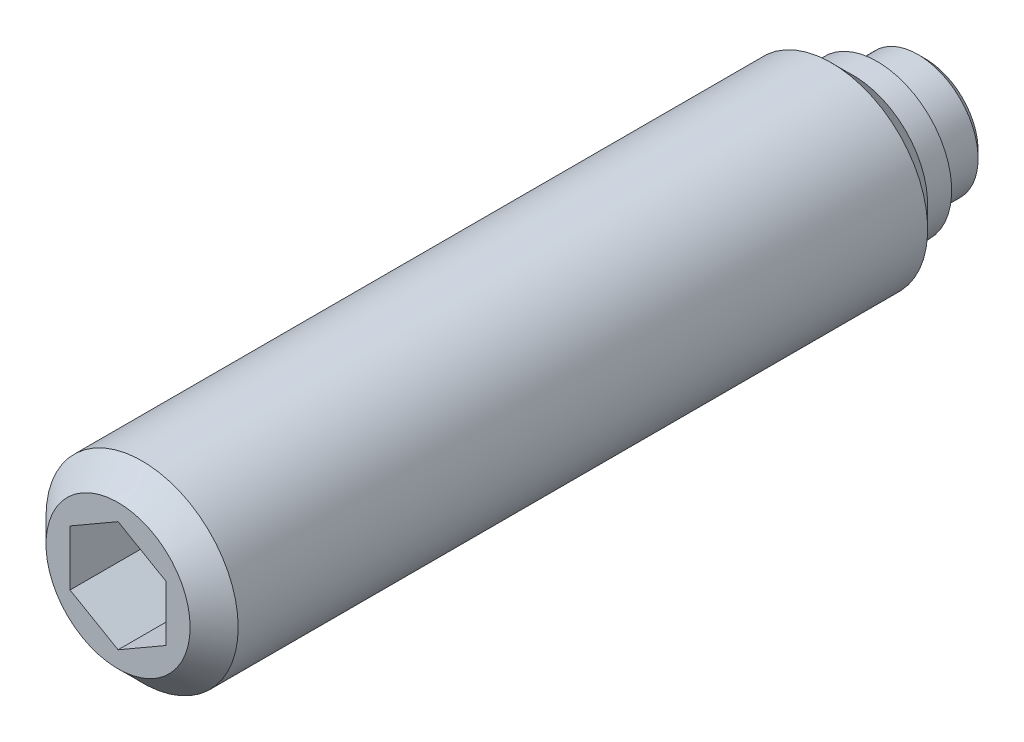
ISO-10303-21;
HEADER;
FILE_DESCRIPTION(('STEP AP214'),'2;1');
FILE_NAME('part.step','',(''),(''),'','','');
FILE_SCHEMA(('AUTOMOTIVE_DESIGN { 1 0 10303 214 1 1 1 1 }'));
ENDSEC;
DATA;
#1=APPLICATION_CONTEXT('core data for automotive mechanical design processes');
#2=APPLICATION_PROTOCOL_DEFINITION('international standard','automotive_design',2000,#1);
#3=PRODUCT_CONTEXT('',#1,'mechanical');
#4=PRODUCT('Part','Part','',(#3));
#5=PRODUCT_RELATED_PRODUCT_CATEGORY('part','',(#4));
#6=PRODUCT_DEFINITION_FORMATION('','',#4);
#7=PRODUCT_DEFINITION_CONTEXT('part definition',#1,'design');
#8=PRODUCT_DEFINITION('design','',#6,#7);
#9=PRODUCT_DEFINITION_SHAPE('','',#8);
#10=(LENGTH_UNIT() NAMED_UNIT(*) SI_UNIT(.MILLI.,.METRE.));
#11=(NAMED_UNIT(*) PLANE_ANGLE_UNIT() SI_UNIT($,.RADIAN.));
#12=(NAMED_UNIT(*) SI_UNIT($,.STERADIAN.) SOLID_ANGLE_UNIT());
#13=UNCERTAINTY_MEASURE_WITH_UNIT(LENGTH_MEASURE(1.E-05),#10,'distance_accuracy_value','');
#14=(GEOMETRIC_REPRESENTATION_CONTEXT(3) GLOBAL_UNCERTAINTY_ASSIGNED_CONTEXT((#13)) GLOBAL_UNIT_ASSIGNED_CONTEXT((#10,
#11,#12)) REPRESENTATION_CONTEXT('',''));
#15=CARTESIAN_POINT('',(0.,0.,0.));
#16=DIRECTION('',(0.,0.,1.));
#17=DIRECTION('',(1.,0.,0.));
#18=AXIS2_PLACEMENT_3D('',#15,#16,#17);
#19=CARTESIAN_POINT('',(0.,0.,0.));
#20=DIRECTION('',(0.,0.,-1.));
#21=DIRECTION('',(-1.,0.,0.));
#22=AXIS2_PLACEMENT_3D('',#19,#20,#21);
#23=CYLINDRICAL_SURFACE('',#22,2.5);
#24=CARTESIAN_POINT('',(0.,0.,0.3));
#25=DIRECTION('',(0.,0.,-1.));
#26=DIRECTION('',(-1.,0.,0.));
#27=AXIS2_PLACEMENT_3D('',#24,#25,#26);
#28=CIRCLE('',#27,2.5);
#29=CARTESIAN_POINT('',(-2.5,0.,0.3));
#30=VERTEX_POINT('',#29);
#31=EDGE_CURVE('E133',#30,#30,#28,.T.);
#32=ORIENTED_EDGE('',*,*,#31,.F.);
#33=EDGE_LOOP('',(#32));
#34=FACE_BOUND('',#33,.T.);
#35=CARTESIAN_POINT('',(0.,0.,2.));
#36=DIRECTION('',(0.,0.,-1.));
#37=DIRECTION('',(-1.,0.,0.));
#38=AXIS2_PLACEMENT_3D('',#35,#36,#37);
#39=CIRCLE('',#38,2.5);
#40=CARTESIAN_POINT('',(-2.5,0.,2.));
#41=VERTEX_POINT('',#40);
#42=EDGE_CURVE('E127',#41,#41,#39,.T.);
#43=ORIENTED_EDGE('',*,*,#42,.T.);
#44=EDGE_LOOP('',(#43));
#45=FACE_BOUND('',#44,.T.);
#46=ADVANCED_FACE('F14',(#34,#45),#23,.T.);
#47=CARTESIAN_POINT('',(0.,0.,0.3));
#48=DIRECTION('',(0.,0.,1.));
#49=DIRECTION('',(1.,0.,0.));
#50=AXIS2_PLACEMENT_3D('',#47,#48,#49);
#51=CONICAL_SURFACE('',#50,2.5,0.785398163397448);
#52=CARTESIAN_POINT('',(0.,0.,0.));
#53=DIRECTION('',(0.,0.,-1.));
#54=DIRECTION('',(-1.,0.,0.));
#55=AXIS2_PLACEMENT_3D('',#52,#53,#54);
#56=CIRCLE('',#55,2.2);
#57=CARTESIAN_POINT('',(-2.2,0.,0.));
#58=VERTEX_POINT('',#57);
#59=EDGE_CURVE('E130',#58,#58,#56,.T.);
#60=ORIENTED_EDGE('',*,*,#59,.F.);
#61=EDGE_LOOP('',(#60));
#62=FACE_BOUND('',#61,.T.);
#63=ORIENTED_EDGE('',*,*,#31,.T.);
#64=EDGE_LOOP('',(#63));
#65=FACE_BOUND('',#64,.T.);
#66=ADVANCED_FACE('F159',(#62,#65),#51,.T.);
#67=CARTESIAN_POINT('',(0.,2.2,0.));
#68=DIRECTION('',(0.,0.,1.));
#69=DIRECTION('',(1.,0.,0.));
#70=AXIS2_PLACEMENT_3D('',#67,#68,#69);
#71=PLANE('',#70);
#72=ORIENTED_EDGE('',*,*,#59,.T.);
#73=EDGE_LOOP('',(#72));
#74=FACE_BOUND('',#73,.T.);
#75=ADVANCED_FACE('F165',(#74),#71,.F.);
#76=CARTESIAN_POINT('',(0.,0.,2.));
#77=DIRECTION('',(0.,0.,-1.));
#78=DIRECTION('',(-1.,0.,0.));
#79=AXIS2_PLACEMENT_3D('',#76,#77,#78);
#80=CYLINDRICAL_SURFACE('',#79,4.);
#81=CARTESIAN_POINT('',(0.,0.,3.9));
#82=DIRECTION('',(0.,0.,-1.));
#83=DIRECTION('',(-1.,0.,0.));
#84=AXIS2_PLACEMENT_3D('',#81,#82,#83);
#85=CIRCLE('',#84,4.);
#86=CARTESIAN_POINT('',(-4.,0.,3.9));
#87=VERTEX_POINT('',#86);
#88=EDGE_CURVE('E9',#87,#87,#85,.T.);
#89=ORIENTED_EDGE('',*,*,#88,.F.);
#90=EDGE_LOOP('',(#89));
#91=FACE_BOUND('',#90,.T.);
#92=CARTESIAN_POINT('',(0.,0.,32.6));
#93=DIRECTION('',(0.,0.,1.));
#94=DIRECTION('',(1.,0.,0.));
#95=AXIS2_PLACEMENT_3D('',#92,#93,#94);
#96=CIRCLE('',#95,4.);
#97=CARTESIAN_POINT('',(4.,0.,32.6));
#98=VERTEX_POINT('',#97);
#99=EDGE_CURVE('E124',#98,#98,#96,.T.);
#100=ORIENTED_EDGE('',*,*,#99,.F.);
#101=EDGE_LOOP('',(#100));
#102=FACE_BOUND('',#101,.T.);
#103=ADVANCED_FACE('F16',(#91,#102),#80,.T.);
#104=CARTESIAN_POINT('',(0.,3.1,2.));
#105=DIRECTION('',(0.,0.,1.));
#106=DIRECTION('',(1.,0.,0.));
#107=AXIS2_PLACEMENT_3D('',#104,#105,#106);
#108=PLANE('',#107);
#109=CARTESIAN_POINT('',(0.,0.,2.));
#110=DIRECTION('',(0.,0.,-1.));
#111=DIRECTION('',(-1.,0.,0.));
#112=AXIS2_PLACEMENT_3D('',#109,#110,#111);
#113=CIRCLE('',#112,3.1);
#114=CARTESIAN_POINT('',(-3.1,0.,2.));
#115=VERTEX_POINT('',#114);
#116=EDGE_CURVE('E136',#115,#115,#113,.T.);
#117=ORIENTED_EDGE('',*,*,#116,.T.);
#118=EDGE_LOOP('',(#117));
#119=FACE_BOUND('',#118,.T.);
#120=ORIENTED_EDGE('',*,*,#42,.F.);
#121=EDGE_LOOP('',(#120));
#122=FACE_BOUND('',#121,.T.);
#123=ADVANCED_FACE('F156',(#119,#122),#108,.F.);
#124=CARTESIAN_POINT('',(0.,0.,2.));
#125=DIRECTION('',(0.,0.,-1.));
#126=DIRECTION('',(-1.,0.,0.));
#127=AXIS2_PLACEMENT_3D('',#124,#125,#126);
#128=CYLINDRICAL_SURFACE('',#127,3.1);
#129=CARTESIAN_POINT('',(0.,0.,3.));
#130=DIRECTION('',(0.,0.,-1.));
#131=DIRECTION('',(-1.,0.,0.));
#132=AXIS2_PLACEMENT_3D('',#129,#130,#131);
#133=CIRCLE('',#132,3.1);
#134=CARTESIAN_POINT('',(-3.1,0.,3.));
#135=VERTEX_POINT('',#134);
#136=EDGE_CURVE('E22',#135,#135,#133,.T.);
#137=ORIENTED_EDGE('',*,*,#136,.T.);
#138=EDGE_LOOP('',(#137));
#139=FACE_BOUND('',#138,.T.);
#140=ORIENTED_EDGE('',*,*,#116,.F.);
#141=EDGE_LOOP('',(#140));
#142=FACE_BOUND('',#141,.T.);
#143=ADVANCED_FACE('F141',(#139,#142),#128,.T.);
#144=CARTESIAN_POINT('',(0.,0.,3.9));
#145=DIRECTION('',(0.,0.,1.));
#146=DIRECTION('',(1.,0.,0.));
#147=AXIS2_PLACEMENT_3D('',#144,#145,#146);
#148=CONICAL_SURFACE('',#147,4.,0.78539816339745);
#149=ORIENTED_EDGE('',*,*,#88,.T.);
#150=EDGE_LOOP('',(#149));
#151=FACE_BOUND('',#150,.T.);
#152=ORIENTED_EDGE('',*,*,#136,.F.);
#153=EDGE_LOOP('',(#152));
#154=FACE_BOUND('',#153,.T.);
#155=ADVANCED_FACE('F144',(#151,#154),#148,.T.);
#156=CARTESIAN_POINT('',(0.,-3.,33.6));
#157=DIRECTION('',(0.,0.,1.));
#158=DIRECTION('',(1.,0.,0.));
#159=AXIS2_PLACEMENT_3D('',#156,#157,#158);
#160=PLANE('',#159);
#161=DIRECTION('',(0.866025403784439,-0.5,0.));
#162=VECTOR('',#161,1.);
#163=CARTESIAN_POINT('',(-2.,-1.15470053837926,33.6));
#164=LINE('',#163,#162);
#165=CARTESIAN_POINT('',(-2.,-1.15470053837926,33.6));
#166=VERTEX_POINT('',#165);
#167=CARTESIAN_POINT('',(0.,-2.30940107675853,33.6));
#168=VERTEX_POINT('',#167);
#169=EDGE_CURVE('E29',#166,#168,#164,.T.);
#170=ORIENTED_EDGE('',*,*,#169,.F.);
#171=DIRECTION('',(0.,-1.,0.));
#172=VECTOR('',#171,1.);
#173=CARTESIAN_POINT('',(-2.,1.15470053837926,33.6));
#174=LINE('',#173,#172);
#175=CARTESIAN_POINT('',(-2.,1.15470053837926,33.6));
#176=VERTEX_POINT('',#175);
#177=EDGE_CURVE('E112',#176,#166,#174,.T.);
#178=ORIENTED_EDGE('',*,*,#177,.F.);
#179=DIRECTION('',(-0.866025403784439,-0.5,0.));
#180=VECTOR('',#179,1.);
#181=CARTESIAN_POINT('',(0.,2.30940107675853,33.6));
#182=LINE('',#181,#180);
#183=CARTESIAN_POINT('',(0.,2.30940107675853,33.6));
#184=VERTEX_POINT('',#183);
#185=EDGE_CURVE('E110',#184,#176,#182,.T.);
#186=ORIENTED_EDGE('',*,*,#185,.F.);
#187=DIRECTION('',(-0.866025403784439,0.5,0.));
#188=VECTOR('',#187,1.);
#189=CARTESIAN_POINT('',(2.,1.15470053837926,33.6));
#190=LINE('',#189,#188);
#191=CARTESIAN_POINT('',(2.,1.15470053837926,33.6));
#192=VERTEX_POINT('',#191);
#193=EDGE_CURVE('E77',#192,#184,#190,.T.);
#194=ORIENTED_EDGE('',*,*,#193,.F.);
#195=DIRECTION('',(0.,1.,0.));
#196=VECTOR('',#195,1.);
#197=CARTESIAN_POINT('',(2.,-1.15470053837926,33.6));
#198=LINE('',#197,#196);
#199=CARTESIAN_POINT('',(2.,-1.15470053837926,33.6));
#200=VERTEX_POINT('',#199);
#201=EDGE_CURVE('E106',#200,#192,#198,.T.);
#202=ORIENTED_EDGE('',*,*,#201,.F.);
#203=DIRECTION('',(0.866025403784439,0.5,0.));
#204=VECTOR('',#203,1.);
#205=CARTESIAN_POINT('',(0.,-2.30940107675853,33.6));
#206=LINE('',#205,#204);
#207=EDGE_CURVE('E103',#168,#200,#206,.T.);
#208=ORIENTED_EDGE('',*,*,#207,.F.);
#209=EDGE_LOOP('',(#170,#178,#186,#194,#202,#208));
#210=FACE_BOUND('',#209,.T.);
#211=CARTESIAN_POINT('',(0.,0.,33.6));
#212=DIRECTION('',(0.,0.,1.));
#213=DIRECTION('',(1.,0.,0.));
#214=AXIS2_PLACEMENT_3D('',#211,#212,#213);
#215=CIRCLE('',#214,3.);
#216=CARTESIAN_POINT('',(3.,0.,33.6));
#217=VERTEX_POINT('',#216);
#218=EDGE_CURVE('E116',#217,#217,#215,.T.);
#219=ORIENTED_EDGE('',*,*,#218,.T.);
#220=EDGE_LOOP('',(#219));
#221=FACE_BOUND('',#220,.T.);
#222=ADVANCED_FACE('F146',(#210,#221),#160,.T.);
#223=CARTESIAN_POINT('',(0.,0.,33.6));
#224=DIRECTION('',(0.,0.,-1.));
#225=DIRECTION('',(-1.,0.,0.));
#226=AXIS2_PLACEMENT_3D('',#223,#224,#225);
#227=CONICAL_SURFACE('',#226,3.,0.785398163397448);
#228=ORIENTED_EDGE('',*,*,#99,.T.);
#229=EDGE_LOOP('',(#228));
#230=FACE_BOUND('',#229,.T.);
#231=ORIENTED_EDGE('',*,*,#218,.F.);
#232=EDGE_LOOP('',(#231));
#233=FACE_BOUND('',#232,.T.);
#234=ADVANCED_FACE('F153',(#230,#233),#227,.T.);
#235=CARTESIAN_POINT('',(-2.,-1.15470053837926,28.6));
#236=DIRECTION('',(-0.5,-0.866025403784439,0.));
#237=DIRECTION('',(0.866025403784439,-0.5,0.));
#238=AXIS2_PLACEMENT_3D('',#235,#236,#237);
#239=PLANE('',#238);
#240=ORIENTED_EDGE('',*,*,#169,.T.);
#241=DIRECTION('',(0.,0.,1.));
#242=VECTOR('',#241,1.);
#243=CARTESIAN_POINT('',(0.,-2.30940107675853,28.6));
#244=LINE('',#243,#242);
#245=CARTESIAN_POINT('',(0.,-2.30940107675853,28.6));
#246=VERTEX_POINT('',#245);
#247=EDGE_CURVE('E59',#246,#168,#244,.T.);
#248=ORIENTED_EDGE('',*,*,#247,.F.);
#249=DIRECTION('',(0.866025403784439,-0.5,0.));
#250=VECTOR('',#249,1.);
#251=CARTESIAN_POINT('',(-2.,-1.15470053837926,28.6));
#252=LINE('',#251,#250);
#253=CARTESIAN_POINT('',(-2.,-1.15470053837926,28.6));
#254=VERTEX_POINT('',#253);
#255=EDGE_CURVE('E114',#254,#246,#252,.T.);
#256=ORIENTED_EDGE('',*,*,#255,.F.);
#257=DIRECTION('',(0.,0.,1.));
#258=VECTOR('',#257,1.);
#259=CARTESIAN_POINT('',(-2.,-1.15470053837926,28.6));
#260=LINE('',#259,#258);
#261=EDGE_CURVE('E37',#254,#166,#260,.T.);
#262=ORIENTED_EDGE('',*,*,#261,.T.);
#263=EDGE_LOOP('',(#240,#248,#256,#262));
#264=FACE_BOUND('',#263,.T.);
#265=ADVANCED_FACE('F191',(#264),#239,.F.);
#266=CARTESIAN_POINT('',(-2.,1.15470053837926,28.6));
#267=DIRECTION('',(-1.,0.,0.));
#268=DIRECTION('',(0.,0.,1.));
#269=AXIS2_PLACEMENT_3D('',#266,#267,#268);
#270=PLANE('',#269);
#271=ORIENTED_EDGE('',*,*,#177,.T.);
#272=ORIENTED_EDGE('',*,*,#261,.F.);
#273=DIRECTION('',(0.,-1.,0.));
#274=VECTOR('',#273,1.);
#275=CARTESIAN_POINT('',(-2.,1.15470053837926,28.6));
#276=LINE('',#275,#274);
#277=CARTESIAN_POINT('',(-2.,1.15470053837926,28.6));
#278=VERTEX_POINT('',#277);
#279=EDGE_CURVE('E89',#278,#254,#276,.T.);
#280=ORIENTED_EDGE('',*,*,#279,.F.);
#281=DIRECTION('',(0.,0.,1.));
#282=VECTOR('',#281,1.);
#283=CARTESIAN_POINT('',(-2.,1.15470053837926,28.6));
#284=LINE('',#283,#282);
#285=EDGE_CURVE('E81',#278,#176,#284,.T.);
#286=ORIENTED_EDGE('',*,*,#285,.T.);
#287=EDGE_LOOP('',(#271,#272,#280,#286));
#288=FACE_BOUND('',#287,.T.);
#289=ADVANCED_FACE('F198',(#288),#270,.F.);
#290=CARTESIAN_POINT('',(0.,2.30940107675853,28.6));
#291=DIRECTION('',(-0.5,0.866025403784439,0.));
#292=DIRECTION('',(-0.866025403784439,-0.5,0.));
#293=AXIS2_PLACEMENT_3D('',#290,#291,#292);
#294=PLANE('',#293);
#295=ORIENTED_EDGE('',*,*,#185,.T.);
#296=ORIENTED_EDGE('',*,*,#285,.F.);
#297=DIRECTION('',(-0.866025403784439,-0.5,0.));
#298=VECTOR('',#297,1.);
#299=CARTESIAN_POINT('',(0.,2.30940107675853,28.6));
#300=LINE('',#299,#298);
#301=CARTESIAN_POINT('',(0.,2.30940107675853,28.6));
#302=VERTEX_POINT('',#301);
#303=EDGE_CURVE('E85',#302,#278,#300,.T.);
#304=ORIENTED_EDGE('',*,*,#303,.F.);
#305=DIRECTION('',(0.,0.,1.));
#306=VECTOR('',#305,1.);
#307=CARTESIAN_POINT('',(0.,2.30940107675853,28.6));
#308=LINE('',#307,#306);
#309=EDGE_CURVE('E70',#302,#184,#308,.T.);
#310=ORIENTED_EDGE('',*,*,#309,.T.);
#311=EDGE_LOOP('',(#295,#296,#304,#310));
#312=FACE_BOUND('',#311,.T.);
#313=ADVANCED_FACE('F86',(#312),#294,.F.);
#314=CARTESIAN_POINT('',(2.,1.15470053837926,28.6));
#315=DIRECTION('',(0.5,0.866025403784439,0.));
#316=DIRECTION('',(-0.866025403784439,0.5,0.));
#317=AXIS2_PLACEMENT_3D('',#314,#315,#316);
#318=PLANE('',#317);
#319=ORIENTED_EDGE('',*,*,#193,.T.);
#320=ORIENTED_EDGE('',*,*,#309,.F.);
#321=DIRECTION('',(-0.866025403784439,0.5,0.));
#322=VECTOR('',#321,1.);
#323=CARTESIAN_POINT('',(2.,1.15470053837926,28.6));
#324=LINE('',#323,#322);
#325=CARTESIAN_POINT('',(2.,1.15470053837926,28.6));
#326=VERTEX_POINT('',#325);
#327=EDGE_CURVE('E74',#326,#302,#324,.T.);
#328=ORIENTED_EDGE('',*,*,#327,.F.);
#329=DIRECTION('',(0.,0.,1.));
#330=VECTOR('',#329,1.);
#331=CARTESIAN_POINT('',(2.,1.15470053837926,28.6));
#332=LINE('',#331,#330);
#333=EDGE_CURVE('E82',#326,#192,#332,.T.);
#334=ORIENTED_EDGE('',*,*,#333,.T.);
#335=EDGE_LOOP('',(#319,#320,#328,#334));
#336=FACE_BOUND('',#335,.T.);
#337=ADVANCED_FACE('F72',(#336),#318,.F.);
#338=CARTESIAN_POINT('',(2.,-1.15470053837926,28.6));
#339=DIRECTION('',(1.,0.,0.));
#340=DIRECTION('',(0.,0.,-1.));
#341=AXIS2_PLACEMENT_3D('',#338,#339,#340);
#342=PLANE('',#341);
#343=ORIENTED_EDGE('',*,*,#201,.T.);
#344=ORIENTED_EDGE('',*,*,#333,.F.);
#345=DIRECTION('',(0.,1.,0.));
#346=VECTOR('',#345,1.);
#347=CARTESIAN_POINT('',(2.,-1.15470053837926,28.6));
#348=LINE('',#347,#346);
#349=CARTESIAN_POINT('',(2.,-1.15470053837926,28.6));
#350=VERTEX_POINT('',#349);
#351=EDGE_CURVE('E95',#350,#326,#348,.T.);
#352=ORIENTED_EDGE('',*,*,#351,.F.);
#353=DIRECTION('',(0.,0.,1.));
#354=VECTOR('',#353,1.);
#355=CARTESIAN_POINT('',(2.,-1.15470053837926,28.6));
#356=LINE('',#355,#354);
#357=EDGE_CURVE('E119',#350,#200,#356,.T.);
#358=ORIENTED_EDGE('',*,*,#357,.T.);
#359=EDGE_LOOP('',(#343,#344,#352,#358));
#360=FACE_BOUND('',#359,.T.);
#361=ADVANCED_FACE('F204',(#360),#342,.F.);
#362=CARTESIAN_POINT('',(0.,-2.30940107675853,28.6));
#363=DIRECTION('',(0.5,-0.866025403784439,0.));
#364=DIRECTION('',(0.866025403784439,0.5,0.));
#365=AXIS2_PLACEMENT_3D('',#362,#363,#364);
#366=PLANE('',#365);
#367=ORIENTED_EDGE('',*,*,#207,.T.);
#368=ORIENTED_EDGE('',*,*,#357,.F.);
#369=DIRECTION('',(0.866025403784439,0.5,0.));
#370=VECTOR('',#369,1.);
#371=CARTESIAN_POINT('',(0.,-2.30940107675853,28.6));
#372=LINE('',#371,#370);
#373=EDGE_CURVE('E97',#246,#350,#372,.T.);
#374=ORIENTED_EDGE('',*,*,#373,.F.);
#375=ORIENTED_EDGE('',*,*,#247,.T.);
#376=EDGE_LOOP('',(#367,#368,#374,#375));
#377=FACE_BOUND('',#376,.T.);
#378=ADVANCED_FACE('F201',(#377),#366,.F.);
#379=CARTESIAN_POINT('',(0.,0.,28.6));
#380=DIRECTION('',(0.,0.,1.));
#381=DIRECTION('',(1.,0.,0.));
#382=AXIS2_PLACEMENT_3D('',#379,#380,#381);
#383=PLANE('',#382);
#384=ORIENTED_EDGE('',*,*,#255,.T.);
#385=ORIENTED_EDGE('',*,*,#373,.T.);
#386=ORIENTED_EDGE('',*,*,#351,.T.);
#387=ORIENTED_EDGE('',*,*,#327,.T.);
#388=ORIENTED_EDGE('',*,*,#303,.T.);
#389=ORIENTED_EDGE('',*,*,#279,.T.);
#390=EDGE_LOOP('',(#384,#385,#386,#387,#388,#389));
#391=FACE_BOUND('',#390,.T.);
#392=ADVANCED_FACE('F92',(#391),#383,.T.);
#393=CLOSED_SHELL('',(#46,#66,#75,#103,#123,#143,#155,#222,#234,#265,#289,#313,#337,#361,#378,#392));
#394=MANIFOLD_SOLID_BREP('B1',#393);
#395=ADVANCED_BREP_SHAPE_REPRESENTATION('',(#18,#394),#14);
#396=SHAPE_DEFINITION_REPRESENTATION(#9,#395);
ENDSEC;
END-ISO-10303-21;
